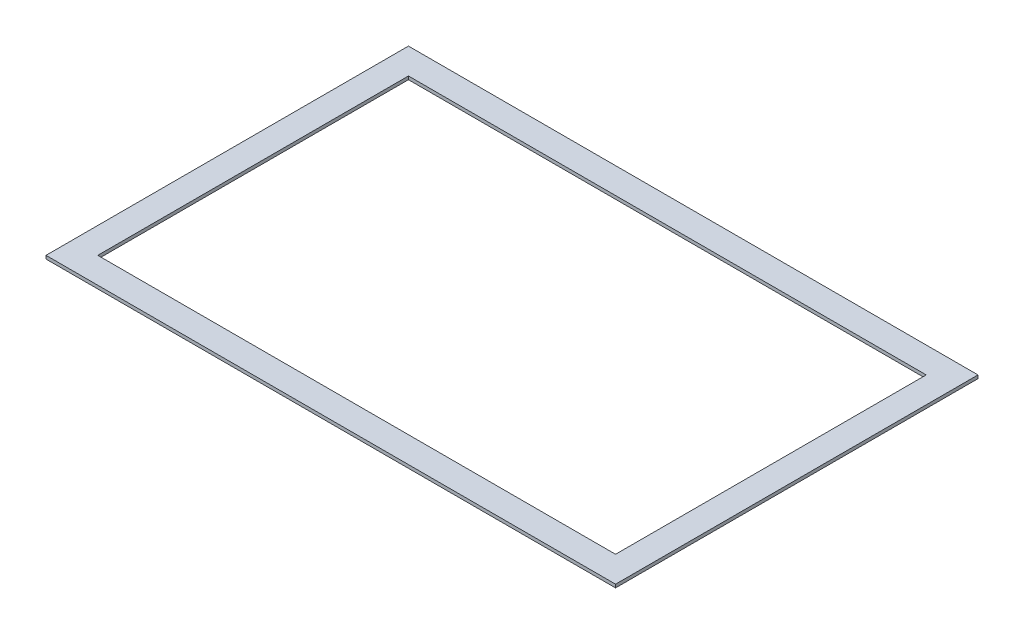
ISO-10303-21;
HEADER;
FILE_DESCRIPTION(('STEP AP214'),'2;1');
FILE_NAME('part.step','',(''),(''),'','','');
FILE_SCHEMA(('AUTOMOTIVE_DESIGN { 1 0 10303 214 1 1 1 1 }'));
ENDSEC;
DATA;
#1=APPLICATION_CONTEXT('core data for automotive mechanical design processes');
#2=APPLICATION_PROTOCOL_DEFINITION('international standard','automotive_design',2000,#1);
#3=PRODUCT_CONTEXT('',#1,'mechanical');
#4=PRODUCT('Part','Part','',(#3));
#5=PRODUCT_RELATED_PRODUCT_CATEGORY('part','',(#4));
#6=PRODUCT_DEFINITION_FORMATION('','',#4);
#7=PRODUCT_DEFINITION_CONTEXT('part definition',#1,'design');
#8=PRODUCT_DEFINITION('design','',#6,#7);
#9=PRODUCT_DEFINITION_SHAPE('','',#8);
#10=(LENGTH_UNIT() NAMED_UNIT(*) SI_UNIT(.MILLI.,.METRE.));
#11=(NAMED_UNIT(*) PLANE_ANGLE_UNIT() SI_UNIT($,.RADIAN.));
#12=(NAMED_UNIT(*) SI_UNIT($,.STERADIAN.) SOLID_ANGLE_UNIT());
#13=UNCERTAINTY_MEASURE_WITH_UNIT(LENGTH_MEASURE(1.E-05),#10,'distance_accuracy_value','');
#14=(GEOMETRIC_REPRESENTATION_CONTEXT(3) GLOBAL_UNCERTAINTY_ASSIGNED_CONTEXT((#13)) GLOBAL_UNIT_ASSIGNED_CONTEXT((#10,
#11,#12)) REPRESENTATION_CONTEXT('',''));
#15=CARTESIAN_POINT('',(0.,0.,0.));
#16=DIRECTION('',(0.,0.,1.));
#17=DIRECTION('',(1.,0.,0.));
#18=AXIS2_PLACEMENT_3D('',#15,#16,#17);
#19=CARTESIAN_POINT('',(-12.7,1.6002,-165.1));
#20=DIRECTION('',(0.,-1.,0.));
#21=DIRECTION('',(0.,0.,-1.));
#22=AXIS2_PLACEMENT_3D('',#19,#20,#21);
#23=PLANE('',#22);
#24=DIRECTION('',(0.,0.,1.));
#25=VECTOR('',#24,1.);
#26=CARTESIAN_POINT('',(-12.7,1.6002,12.7));
#27=LINE('',#26,#25);
#28=CARTESIAN_POINT('',(-12.7,1.6002,-165.1));
#29=VERTEX_POINT('',#28);
#30=CARTESIAN_POINT('',(-12.7,1.6002,12.7));
#31=VERTEX_POINT('',#30);
#32=EDGE_CURVE('E132',#29,#31,#27,.T.);
#33=ORIENTED_EDGE('',*,*,#32,.T.);
#34=DIRECTION('',(1.,0.,0.));
#35=VECTOR('',#34,1.);
#36=CARTESIAN_POINT('',(-12.7,1.6002,12.7));
#37=LINE('',#36,#35);
#38=CARTESIAN_POINT('',(266.7,1.6002,12.7));
#39=VERTEX_POINT('',#38);
#40=EDGE_CURVE('E135',#31,#39,#37,.T.);
#41=ORIENTED_EDGE('',*,*,#40,.T.);
#42=DIRECTION('',(0.,0.,-1.));
#43=VECTOR('',#42,1.);
#44=CARTESIAN_POINT('',(266.7,1.6002,12.7));
#45=LINE('',#44,#43);
#46=CARTESIAN_POINT('',(266.7,1.6002,-165.1));
#47=VERTEX_POINT('',#46);
#48=EDGE_CURVE('E138',#39,#47,#45,.T.);
#49=ORIENTED_EDGE('',*,*,#48,.T.);
#50=DIRECTION('',(-1.,0.,0.));
#51=VECTOR('',#50,1.);
#52=CARTESIAN_POINT('',(-12.7,1.6002,-165.1));
#53=LINE('',#52,#51);
#54=EDGE_CURVE('E140',#47,#29,#53,.T.);
#55=ORIENTED_EDGE('',*,*,#54,.T.);
#56=EDGE_LOOP('',(#33,#41,#49,#55));
#57=FACE_BOUND('',#56,.T.);
#58=DIRECTION('',(0.,0.,1.));
#59=VECTOR('',#58,1.);
#60=CARTESIAN_POINT('',(0.,1.6002,0.));
#61=LINE('',#60,#59);
#62=CARTESIAN_POINT('',(0.,1.6002,-152.4));
#63=VERTEX_POINT('',#62);
#64=CARTESIAN_POINT('',(0.,1.6002,0.));
#65=VERTEX_POINT('',#64);
#66=EDGE_CURVE('E96',#63,#65,#61,.T.);
#67=ORIENTED_EDGE('',*,*,#66,.F.);
#68=DIRECTION('',(-1.,0.,0.));
#69=VECTOR('',#68,1.);
#70=CARTESIAN_POINT('',(0.,1.6002,-152.4));
#71=LINE('',#70,#69);
#72=CARTESIAN_POINT('',(254.,1.6002,-152.4));
#73=VERTEX_POINT('',#72);
#74=EDGE_CURVE('E118',#73,#63,#71,.T.);
#75=ORIENTED_EDGE('',*,*,#74,.F.);
#76=DIRECTION('',(0.,0.,-1.));
#77=VECTOR('',#76,1.);
#78=CARTESIAN_POINT('',(254.,1.6002,0.));
#79=LINE('',#78,#77);
#80=CARTESIAN_POINT('',(254.,1.6002,0.));
#81=VERTEX_POINT('',#80);
#82=EDGE_CURVE('E116',#81,#73,#79,.T.);
#83=ORIENTED_EDGE('',*,*,#82,.F.);
#84=DIRECTION('',(1.,0.,0.));
#85=VECTOR('',#84,1.);
#86=CARTESIAN_POINT('',(0.,1.6002,0.));
#87=LINE('',#86,#85);
#88=EDGE_CURVE('E104',#65,#81,#87,.T.);
#89=ORIENTED_EDGE('',*,*,#88,.F.);
#90=EDGE_LOOP('',(#67,#75,#83,#89));
#91=FACE_BOUND('',#90,.T.);
#92=ADVANCED_FACE('F31',(#57,#91),#23,.F.);
#93=CARTESIAN_POINT('',(-12.7,0.,-165.1));
#94=DIRECTION('',(0.,-1.,0.));
#95=DIRECTION('',(0.,0.,-1.));
#96=AXIS2_PLACEMENT_3D('',#93,#94,#95);
#97=PLANE('',#96);
#98=DIRECTION('',(0.,0.,1.));
#99=VECTOR('',#98,1.);
#100=CARTESIAN_POINT('',(-12.7,0.,12.7));
#101=LINE('',#100,#99);
#102=CARTESIAN_POINT('',(-12.7,0.,-165.1));
#103=VERTEX_POINT('',#102);
#104=CARTESIAN_POINT('',(-12.7,0.,12.7));
#105=VERTEX_POINT('',#104);
#106=EDGE_CURVE('E112',#103,#105,#101,.T.);
#107=ORIENTED_EDGE('',*,*,#106,.F.);
#108=DIRECTION('',(-1.,0.,0.));
#109=VECTOR('',#108,1.);
#110=CARTESIAN_POINT('',(-12.7,0.,-165.1));
#111=LINE('',#110,#109);
#112=CARTESIAN_POINT('',(266.7,0.,-165.1));
#113=VERTEX_POINT('',#112);
#114=EDGE_CURVE('E136',#113,#103,#111,.T.);
#115=ORIENTED_EDGE('',*,*,#114,.F.);
#116=DIRECTION('',(0.,0.,-1.));
#117=VECTOR('',#116,1.);
#118=CARTESIAN_POINT('',(266.7,0.,12.7));
#119=LINE('',#118,#117);
#120=CARTESIAN_POINT('',(266.7,0.,12.7));
#121=VERTEX_POINT('',#120);
#122=EDGE_CURVE('E147',#121,#113,#119,.T.);
#123=ORIENTED_EDGE('',*,*,#122,.F.);
#124=DIRECTION('',(1.,0.,0.));
#125=VECTOR('',#124,1.);
#126=CARTESIAN_POINT('',(-12.7,0.,12.7));
#127=LINE('',#126,#125);
#128=EDGE_CURVE('E145',#105,#121,#127,.T.);
#129=ORIENTED_EDGE('',*,*,#128,.F.);
#130=EDGE_LOOP('',(#107,#115,#123,#129));
#131=FACE_BOUND('',#130,.T.);
#132=DIRECTION('',(-1.,0.,0.));
#133=VECTOR('',#132,1.);
#134=CARTESIAN_POINT('',(0.,0.,-152.4));
#135=LINE('',#134,#133);
#136=CARTESIAN_POINT('',(254.,0.,-152.4));
#137=VERTEX_POINT('',#136);
#138=CARTESIAN_POINT('',(0.,0.,-152.4));
#139=VERTEX_POINT('',#138);
#140=EDGE_CURVE('E105',#137,#139,#135,.T.);
#141=ORIENTED_EDGE('',*,*,#140,.T.);
#142=DIRECTION('',(0.,0.,1.));
#143=VECTOR('',#142,1.);
#144=CARTESIAN_POINT('',(0.,0.,0.));
#145=LINE('',#144,#143);
#146=CARTESIAN_POINT('',(0.,0.,0.));
#147=VERTEX_POINT('',#146);
#148=EDGE_CURVE('E54',#139,#147,#145,.T.);
#149=ORIENTED_EDGE('',*,*,#148,.T.);
#150=DIRECTION('',(1.,0.,0.));
#151=VECTOR('',#150,1.);
#152=CARTESIAN_POINT('',(0.,0.,0.));
#153=LINE('',#152,#151);
#154=CARTESIAN_POINT('',(254.,0.,0.));
#155=VERTEX_POINT('',#154);
#156=EDGE_CURVE('E111',#147,#155,#153,.T.);
#157=ORIENTED_EDGE('',*,*,#156,.T.);
#158=DIRECTION('',(0.,0.,-1.));
#159=VECTOR('',#158,1.);
#160=CARTESIAN_POINT('',(254.,0.,0.));
#161=LINE('',#160,#159);
#162=EDGE_CURVE('E124',#155,#137,#161,.T.);
#163=ORIENTED_EDGE('',*,*,#162,.T.);
#164=EDGE_LOOP('',(#141,#149,#157,#163));
#165=FACE_BOUND('',#164,.T.);
#166=ADVANCED_FACE('F165',(#131,#165),#97,.T.);
#167=CARTESIAN_POINT('',(-12.7,1.6002,12.7));
#168=DIRECTION('',(1.,0.,0.));
#169=DIRECTION('',(0.,0.,-1.));
#170=AXIS2_PLACEMENT_3D('',#167,#168,#169);
#171=PLANE('',#170);
#172=ORIENTED_EDGE('',*,*,#106,.T.);
#173=DIRECTION('',(0.,-1.,0.));
#174=VECTOR('',#173,1.);
#175=CARTESIAN_POINT('',(-12.7,1.6002,12.7));
#176=LINE('',#175,#174);
#177=EDGE_CURVE('E11',#31,#105,#176,.T.);
#178=ORIENTED_EDGE('',*,*,#177,.F.);
#179=ORIENTED_EDGE('',*,*,#32,.F.);
#180=DIRECTION('',(0.,-1.,0.));
#181=VECTOR('',#180,1.);
#182=CARTESIAN_POINT('',(-12.7,1.6002,-165.1));
#183=LINE('',#182,#181);
#184=EDGE_CURVE('E142',#29,#103,#183,.T.);
#185=ORIENTED_EDGE('',*,*,#184,.T.);
#186=EDGE_LOOP('',(#172,#178,#179,#185));
#187=FACE_BOUND('',#186,.T.);
#188=ADVANCED_FACE('F33',(#187),#171,.F.);
#189=CARTESIAN_POINT('',(-12.7,1.6002,12.7));
#190=DIRECTION('',(0.,0.,-1.));
#191=DIRECTION('',(-1.,0.,0.));
#192=AXIS2_PLACEMENT_3D('',#189,#190,#191);
#193=PLANE('',#192);
#194=ORIENTED_EDGE('',*,*,#128,.T.);
#195=DIRECTION('',(0.,-1.,0.));
#196=VECTOR('',#195,1.);
#197=CARTESIAN_POINT('',(266.7,1.6002,12.7));
#198=LINE('',#197,#196);
#199=EDGE_CURVE('E39',#39,#121,#198,.T.);
#200=ORIENTED_EDGE('',*,*,#199,.F.);
#201=ORIENTED_EDGE('',*,*,#40,.F.);
#202=ORIENTED_EDGE('',*,*,#177,.T.);
#203=EDGE_LOOP('',(#194,#200,#201,#202));
#204=FACE_BOUND('',#203,.T.);
#205=ADVANCED_FACE('F175',(#204),#193,.F.);
#206=CARTESIAN_POINT('',(266.7,1.6002,12.7));
#207=DIRECTION('',(-1.,0.,0.));
#208=DIRECTION('',(0.,0.,1.));
#209=AXIS2_PLACEMENT_3D('',#206,#207,#208);
#210=PLANE('',#209);
#211=ORIENTED_EDGE('',*,*,#122,.T.);
#212=DIRECTION('',(0.,-1.,0.));
#213=VECTOR('',#212,1.);
#214=CARTESIAN_POINT('',(266.7,1.6002,-165.1));
#215=LINE('',#214,#213);
#216=EDGE_CURVE('E152',#47,#113,#215,.T.);
#217=ORIENTED_EDGE('',*,*,#216,.F.);
#218=ORIENTED_EDGE('',*,*,#48,.F.);
#219=ORIENTED_EDGE('',*,*,#199,.T.);
#220=EDGE_LOOP('',(#211,#217,#218,#219));
#221=FACE_BOUND('',#220,.T.);
#222=ADVANCED_FACE('F159',(#221),#210,.F.);
#223=CARTESIAN_POINT('',(-12.7,1.6002,-165.1));
#224=DIRECTION('',(0.,0.,1.));
#225=DIRECTION('',(1.,0.,0.));
#226=AXIS2_PLACEMENT_3D('',#223,#224,#225);
#227=PLANE('',#226);
#228=ORIENTED_EDGE('',*,*,#114,.T.);
#229=ORIENTED_EDGE('',*,*,#184,.F.);
#230=ORIENTED_EDGE('',*,*,#54,.F.);
#231=ORIENTED_EDGE('',*,*,#216,.T.);
#232=EDGE_LOOP('',(#228,#229,#230,#231));
#233=FACE_BOUND('',#232,.T.);
#234=ADVANCED_FACE('F169',(#233),#227,.F.);
#235=CARTESIAN_POINT('',(0.,1.6002,0.));
#236=DIRECTION('',(1.,0.,0.));
#237=DIRECTION('',(0.,0.,-1.));
#238=AXIS2_PLACEMENT_3D('',#235,#236,#237);
#239=PLANE('',#238);
#240=ORIENTED_EDGE('',*,*,#148,.F.);
#241=DIRECTION('',(0.,-1.,0.));
#242=VECTOR('',#241,1.);
#243=CARTESIAN_POINT('',(0.,1.6002,-152.4));
#244=LINE('',#243,#242);
#245=EDGE_CURVE('E100',#63,#139,#244,.T.);
#246=ORIENTED_EDGE('',*,*,#245,.F.);
#247=ORIENTED_EDGE('',*,*,#66,.T.);
#248=DIRECTION('',(0.,-1.,0.));
#249=VECTOR('',#248,1.);
#250=CARTESIAN_POINT('',(0.,1.6002,0.));
#251=LINE('',#250,#249);
#252=EDGE_CURVE('E99',#65,#147,#251,.T.);
#253=ORIENTED_EDGE('',*,*,#252,.T.);
#254=EDGE_LOOP('',(#240,#246,#247,#253));
#255=FACE_BOUND('',#254,.T.);
#256=ADVANCED_FACE('F98',(#255),#239,.T.);
#257=CARTESIAN_POINT('',(0.,1.6002,0.));
#258=DIRECTION('',(0.,0.,-1.));
#259=DIRECTION('',(-1.,0.,0.));
#260=AXIS2_PLACEMENT_3D('',#257,#258,#259);
#261=PLANE('',#260);
#262=ORIENTED_EDGE('',*,*,#156,.F.);
#263=ORIENTED_EDGE('',*,*,#252,.F.);
#264=ORIENTED_EDGE('',*,*,#88,.T.);
#265=DIRECTION('',(0.,-1.,0.));
#266=VECTOR('',#265,1.);
#267=CARTESIAN_POINT('',(254.,1.6002,0.));
#268=LINE('',#267,#266);
#269=EDGE_CURVE('E113',#81,#155,#268,.T.);
#270=ORIENTED_EDGE('',*,*,#269,.T.);
#271=EDGE_LOOP('',(#262,#263,#264,#270));
#272=FACE_BOUND('',#271,.T.);
#273=ADVANCED_FACE('F108',(#272),#261,.T.);
#274=CARTESIAN_POINT('',(254.,1.6002,0.));
#275=DIRECTION('',(-1.,0.,0.));
#276=DIRECTION('',(0.,0.,1.));
#277=AXIS2_PLACEMENT_3D('',#274,#275,#276);
#278=PLANE('',#277);
#279=ORIENTED_EDGE('',*,*,#162,.F.);
#280=ORIENTED_EDGE('',*,*,#269,.F.);
#281=ORIENTED_EDGE('',*,*,#82,.T.);
#282=DIRECTION('',(0.,-1.,0.));
#283=VECTOR('',#282,1.);
#284=CARTESIAN_POINT('',(254.,1.6002,-152.4));
#285=LINE('',#284,#283);
#286=EDGE_CURVE('E46',#73,#137,#285,.T.);
#287=ORIENTED_EDGE('',*,*,#286,.T.);
#288=EDGE_LOOP('',(#279,#280,#281,#287));
#289=FACE_BOUND('',#288,.T.);
#290=ADVANCED_FACE('F198',(#289),#278,.T.);
#291=CARTESIAN_POINT('',(0.,1.6002,-152.4));
#292=DIRECTION('',(0.,0.,1.));
#293=DIRECTION('',(1.,0.,0.));
#294=AXIS2_PLACEMENT_3D('',#291,#292,#293);
#295=PLANE('',#294);
#296=ORIENTED_EDGE('',*,*,#140,.F.);
#297=ORIENTED_EDGE('',*,*,#286,.F.);
#298=ORIENTED_EDGE('',*,*,#74,.T.);
#299=ORIENTED_EDGE('',*,*,#245,.T.);
#300=EDGE_LOOP('',(#296,#297,#298,#299));
#301=FACE_BOUND('',#300,.T.);
#302=ADVANCED_FACE('F202',(#301),#295,.T.);
#303=CLOSED_SHELL('',(#92,#166,#188,#205,#222,#234,#256,#273,#290,#302));
#304=MANIFOLD_SOLID_BREP('B2',#303);
#305=ADVANCED_BREP_SHAPE_REPRESENTATION('',(#18,#304),#14);
#306=SHAPE_DEFINITION_REPRESENTATION(#9,#305);
ENDSEC;
END-ISO-10303-21;
